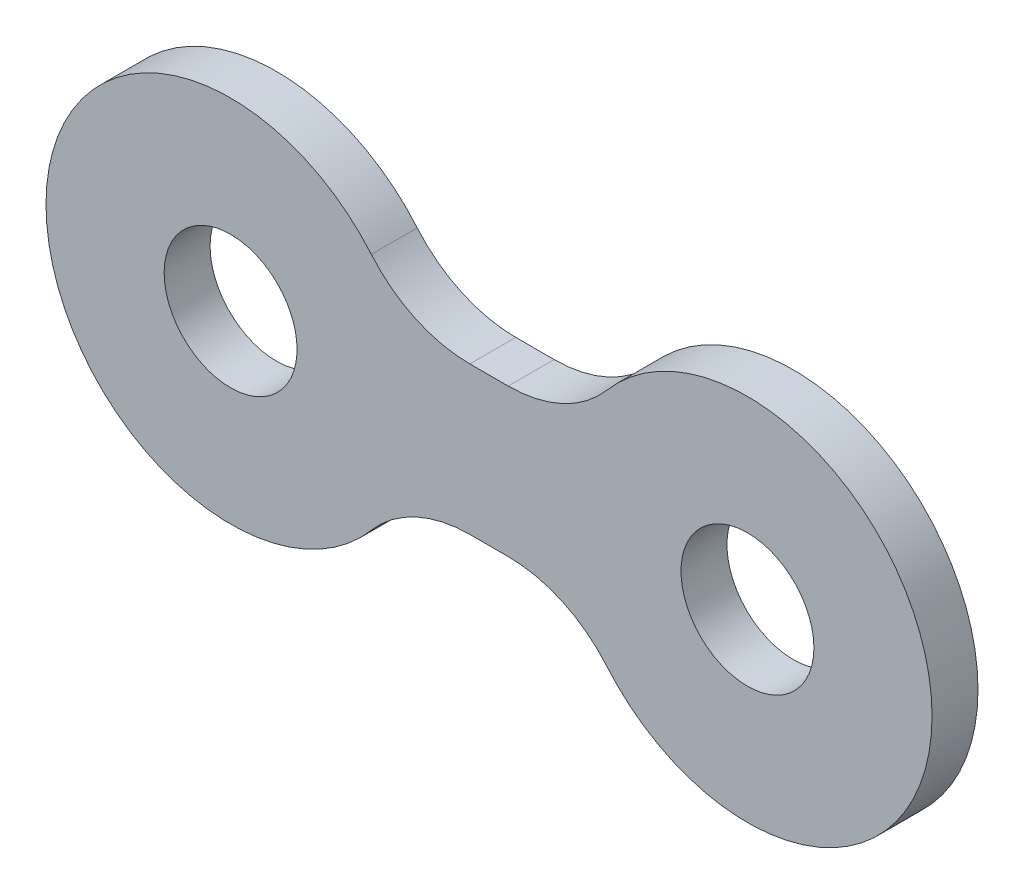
ISO-10303-21;
HEADER;
FILE_DESCRIPTION(('STEP AP214'),'2;1');
FILE_NAME('part.step','',(''),(''),'','','');
FILE_SCHEMA(('AUTOMOTIVE_DESIGN { 1 0 10303 214 1 1 1 1 }'));
ENDSEC;
DATA;
#1=APPLICATION_CONTEXT('core data for automotive mechanical design processes');
#2=APPLICATION_PROTOCOL_DEFINITION('international standard','automotive_design',2000,#1);
#3=PRODUCT_CONTEXT('',#1,'mechanical');
#4=PRODUCT('Part','Part','',(#3));
#5=PRODUCT_RELATED_PRODUCT_CATEGORY('part','',(#4));
#6=PRODUCT_DEFINITION_FORMATION('','',#4);
#7=PRODUCT_DEFINITION_CONTEXT('part definition',#1,'design');
#8=PRODUCT_DEFINITION('design','',#6,#7);
#9=PRODUCT_DEFINITION_SHAPE('','',#8);
#10=(LENGTH_UNIT() NAMED_UNIT(*) SI_UNIT(.MILLI.,.METRE.));
#11=(NAMED_UNIT(*) PLANE_ANGLE_UNIT() SI_UNIT($,.RADIAN.));
#12=(NAMED_UNIT(*) SI_UNIT($,.STERADIAN.) SOLID_ANGLE_UNIT());
#13=UNCERTAINTY_MEASURE_WITH_UNIT(LENGTH_MEASURE(1.E-05),#10,'distance_accuracy_value','');
#14=(GEOMETRIC_REPRESENTATION_CONTEXT(3) GLOBAL_UNCERTAINTY_ASSIGNED_CONTEXT((#13)) GLOBAL_UNIT_ASSIGNED_CONTEXT((#10,
#11,#12)) REPRESENTATION_CONTEXT('',''));
#15=CARTESIAN_POINT('',(0.,0.,0.));
#16=DIRECTION('',(0.,0.,1.));
#17=DIRECTION('',(1.,0.,0.));
#18=AXIS2_PLACEMENT_3D('',#15,#16,#17);
#19=CARTESIAN_POINT('',(-7.,0.,1.2446));
#20=DIRECTION('',(0.,0.,1.));
#21=DIRECTION('',(1.,0.,0.));
#22=AXIS2_PLACEMENT_3D('',#19,#20,#21);
#23=PLANE('',#22);
#24=CARTESIAN_POINT('',(7.,0.,1.2446));
#25=DIRECTION('',(0.,0.,1.));
#26=DIRECTION('',(1.,0.,0.));
#27=AXIS2_PLACEMENT_3D('',#24,#25,#26);
#28=CIRCLE('',#27,1.8);
#29=CARTESIAN_POINT('',(8.8,0.,1.2446));
#30=VERTEX_POINT('',#29);
#31=EDGE_CURVE('E176',#30,#30,#28,.T.);
#32=ORIENTED_EDGE('',*,*,#31,.F.);
#33=EDGE_LOOP('',(#32));
#34=FACE_BOUND('',#33,.T.);
#35=DIRECTION('',(-1.,0.,0.));
#36=VECTOR('',#35,1.);
#37=CARTESIAN_POINT('',(-2.41742430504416,2.,1.2446));
#38=LINE('',#37,#36);
#39=CARTESIAN_POINT('',(0.519259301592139,2.,1.2446));
#40=VERTEX_POINT('',#39);
#41=CARTESIAN_POINT('',(-0.519259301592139,2.,1.2446));
#42=VERTEX_POINT('',#41);
#43=EDGE_CURVE('E135',#40,#42,#38,.T.);
#44=ORIENTED_EDGE('',*,*,#43,.T.);
#45=CARTESIAN_POINT('',(-0.519259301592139,5.5,1.2446));
#46=DIRECTION('',(0.,0.,1.));
#47=DIRECTION('',(1.,0.,0.));
#48=AXIS2_PLACEMENT_3D('',#45,#46,#47);
#49=CIRCLE('',#48,3.5);
#50=CARTESIAN_POINT('',(-3.18779958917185,3.23529411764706,1.2446));
#51=VERTEX_POINT('',#50);
#52=EDGE_CURVE('E11',#42,#51,#49,.F.);
#53=ORIENTED_EDGE('',*,*,#52,.T.);
#54=CARTESIAN_POINT('',(-7.,0.,1.2446));
#55=DIRECTION('',(0.,0.,1.));
#56=DIRECTION('',(1.,0.,0.));
#57=AXIS2_PLACEMENT_3D('',#54,#55,#56);
#58=CIRCLE('',#57,5.);
#59=CARTESIAN_POINT('',(-3.18779958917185,-3.23529411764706,1.2446));
#60=VERTEX_POINT('',#59);
#61=EDGE_CURVE('E129',#51,#60,#58,.T.);
#62=ORIENTED_EDGE('',*,*,#61,.T.);
#63=CARTESIAN_POINT('',(-0.519259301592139,-5.5,1.2446));
#64=DIRECTION('',(0.,0.,1.));
#65=DIRECTION('',(1.,0.,0.));
#66=AXIS2_PLACEMENT_3D('',#63,#64,#65);
#67=CIRCLE('',#66,3.5);
#68=CARTESIAN_POINT('',(-0.519259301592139,-2.,1.2446));
#69=VERTEX_POINT('',#68);
#70=EDGE_CURVE('E151',#60,#69,#67,.F.);
#71=ORIENTED_EDGE('',*,*,#70,.T.);
#72=DIRECTION('',(1.,0.,0.));
#73=VECTOR('',#72,1.);
#74=CARTESIAN_POINT('',(-2.41742430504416,-2.,1.2446));
#75=LINE('',#74,#73);
#76=CARTESIAN_POINT('',(0.519259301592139,-2.,1.2446));
#77=VERTEX_POINT('',#76);
#78=EDGE_CURVE('E167',#69,#77,#75,.T.);
#79=ORIENTED_EDGE('',*,*,#78,.T.);
#80=CARTESIAN_POINT('',(0.519259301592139,-5.5,1.2446));
#81=DIRECTION('',(0.,0.,1.));
#82=DIRECTION('',(1.,0.,0.));
#83=AXIS2_PLACEMENT_3D('',#80,#81,#82);
#84=CIRCLE('',#83,3.5);
#85=CARTESIAN_POINT('',(3.18779958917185,-3.23529411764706,1.2446));
#86=VERTEX_POINT('',#85);
#87=EDGE_CURVE('E108',#77,#86,#84,.F.);
#88=ORIENTED_EDGE('',*,*,#87,.T.);
#89=CARTESIAN_POINT('',(7.,0.,1.2446));
#90=DIRECTION('',(0.,0.,1.));
#91=DIRECTION('',(-1.,0.,0.));
#92=AXIS2_PLACEMENT_3D('',#89,#90,#91);
#93=CIRCLE('',#92,5.);
#94=CARTESIAN_POINT('',(3.18779958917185,3.23529411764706,1.2446));
#95=VERTEX_POINT('',#94);
#96=EDGE_CURVE('E117',#86,#95,#93,.T.);
#97=ORIENTED_EDGE('',*,*,#96,.T.);
#98=CARTESIAN_POINT('',(0.519259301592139,5.5,1.2446));
#99=DIRECTION('',(0.,0.,1.));
#100=DIRECTION('',(1.,0.,0.));
#101=AXIS2_PLACEMENT_3D('',#98,#99,#100);
#102=CIRCLE('',#101,3.5);
#103=EDGE_CURVE('E54',#95,#40,#102,.F.);
#104=ORIENTED_EDGE('',*,*,#103,.T.);
#105=EDGE_LOOP('',(#44,#53,#62,#71,#79,#88,#97,#104));
#106=FACE_BOUND('',#105,.T.);
#107=CARTESIAN_POINT('',(-7.,0.,1.2446));
#108=DIRECTION('',(0.,0.,1.));
#109=DIRECTION('',(-1.,0.,0.));
#110=AXIS2_PLACEMENT_3D('',#107,#108,#109);
#111=CIRCLE('',#110,1.8);
#112=CARTESIAN_POINT('',(-8.8,0.,1.2446));
#113=VERTEX_POINT('',#112);
#114=EDGE_CURVE('E181',#113,#113,#111,.T.);
#115=ORIENTED_EDGE('',*,*,#114,.F.);
#116=EDGE_LOOP('',(#115));
#117=FACE_BOUND('',#116,.T.);
#118=ADVANCED_FACE('F32',(#34,#106,#117),#23,.T.);
#119=CARTESIAN_POINT('',(-7.,0.,0.));
#120=DIRECTION('',(0.,0.,1.));
#121=DIRECTION('',(1.,0.,0.));
#122=AXIS2_PLACEMENT_3D('',#119,#120,#121);
#123=PLANE('',#122);
#124=CARTESIAN_POINT('',(7.,0.,0.));
#125=DIRECTION('',(0.,0.,1.));
#126=DIRECTION('',(1.,0.,0.));
#127=AXIS2_PLACEMENT_3D('',#124,#125,#126);
#128=CIRCLE('',#127,1.8);
#129=CARTESIAN_POINT('',(8.8,0.,0.));
#130=VERTEX_POINT('',#129);
#131=EDGE_CURVE('E172',#130,#130,#128,.T.);
#132=ORIENTED_EDGE('',*,*,#131,.T.);
#133=EDGE_LOOP('',(#132));
#134=FACE_BOUND('',#133,.T.);
#135=CARTESIAN_POINT('',(-7.,0.,0.));
#136=DIRECTION('',(0.,0.,1.));
#137=DIRECTION('',(1.,0.,0.));
#138=AXIS2_PLACEMENT_3D('',#135,#136,#137);
#139=CIRCLE('',#138,5.);
#140=CARTESIAN_POINT('',(-3.18779958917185,3.23529411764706,0.));
#141=VERTEX_POINT('',#140);
#142=CARTESIAN_POINT('',(-3.18779958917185,-3.23529411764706,0.));
#143=VERTEX_POINT('',#142);
#144=EDGE_CURVE('E131',#141,#143,#139,.T.);
#145=ORIENTED_EDGE('',*,*,#144,.F.);
#146=CARTESIAN_POINT('',(-0.519259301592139,5.5,0.));
#147=DIRECTION('',(0.,0.,1.));
#148=DIRECTION('',(1.,0.,0.));
#149=AXIS2_PLACEMENT_3D('',#146,#147,#148);
#150=CIRCLE('',#149,3.5);
#151=CARTESIAN_POINT('',(-0.519259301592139,2.,0.));
#152=VERTEX_POINT('',#151);
#153=EDGE_CURVE('E40',#141,#152,#150,.T.);
#154=ORIENTED_EDGE('',*,*,#153,.T.);
#155=DIRECTION('',(-1.,0.,0.));
#156=VECTOR('',#155,1.);
#157=CARTESIAN_POINT('',(-2.41742430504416,2.,0.));
#158=LINE('',#157,#156);
#159=CARTESIAN_POINT('',(0.519259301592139,2.,0.));
#160=VERTEX_POINT('',#159);
#161=EDGE_CURVE('E126',#160,#152,#158,.T.);
#162=ORIENTED_EDGE('',*,*,#161,.F.);
#163=CARTESIAN_POINT('',(0.519259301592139,5.5,0.));
#164=DIRECTION('',(0.,0.,1.));
#165=DIRECTION('',(1.,0.,0.));
#166=AXIS2_PLACEMENT_3D('',#163,#164,#165);
#167=CIRCLE('',#166,3.5);
#168=CARTESIAN_POINT('',(3.18779958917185,3.23529411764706,0.));
#169=VERTEX_POINT('',#168);
#170=EDGE_CURVE('E125',#160,#169,#167,.T.);
#171=ORIENTED_EDGE('',*,*,#170,.T.);
#172=CARTESIAN_POINT('',(7.,0.,0.));
#173=DIRECTION('',(0.,0.,1.));
#174=DIRECTION('',(-1.,0.,0.));
#175=AXIS2_PLACEMENT_3D('',#172,#173,#174);
#176=CIRCLE('',#175,5.);
#177=CARTESIAN_POINT('',(3.18779958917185,-3.23529411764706,0.));
#178=VERTEX_POINT('',#177);
#179=EDGE_CURVE('E115',#178,#169,#176,.T.);
#180=ORIENTED_EDGE('',*,*,#179,.F.);
#181=CARTESIAN_POINT('',(0.519259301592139,-5.5,0.));
#182=DIRECTION('',(0.,0.,1.));
#183=DIRECTION('',(1.,0.,0.));
#184=AXIS2_PLACEMENT_3D('',#181,#182,#183);
#185=CIRCLE('',#184,3.5);
#186=CARTESIAN_POINT('',(0.519259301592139,-2.,0.));
#187=VERTEX_POINT('',#186);
#188=EDGE_CURVE('E98',#178,#187,#185,.T.);
#189=ORIENTED_EDGE('',*,*,#188,.T.);
#190=DIRECTION('',(1.,0.,0.));
#191=VECTOR('',#190,1.);
#192=CARTESIAN_POINT('',(-2.41742430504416,-2.,0.));
#193=LINE('',#192,#191);
#194=CARTESIAN_POINT('',(-0.519259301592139,-2.,0.));
#195=VERTEX_POINT('',#194);
#196=EDGE_CURVE('E127',#195,#187,#193,.T.);
#197=ORIENTED_EDGE('',*,*,#196,.F.);
#198=CARTESIAN_POINT('',(-0.519259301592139,-5.5,0.));
#199=DIRECTION('',(0.,0.,1.));
#200=DIRECTION('',(1.,0.,0.));
#201=AXIS2_PLACEMENT_3D('',#198,#199,#200);
#202=CIRCLE('',#201,3.5);
#203=EDGE_CURVE('E149',#195,#143,#202,.T.);
#204=ORIENTED_EDGE('',*,*,#203,.T.);
#205=EDGE_LOOP('',(#145,#154,#162,#171,#180,#189,#197,#204));
#206=FACE_BOUND('',#205,.T.);
#207=CARTESIAN_POINT('',(-7.,0.,0.));
#208=DIRECTION('',(0.,0.,1.));
#209=DIRECTION('',(-1.,0.,0.));
#210=AXIS2_PLACEMENT_3D('',#207,#208,#209);
#211=CIRCLE('',#210,1.8);
#212=CARTESIAN_POINT('',(-8.8,0.,0.));
#213=VERTEX_POINT('',#212);
#214=EDGE_CURVE('E183',#213,#213,#211,.T.);
#215=ORIENTED_EDGE('',*,*,#214,.T.);
#216=EDGE_LOOP('',(#215));
#217=FACE_BOUND('',#216,.T.);
#218=ADVANCED_FACE('F122',(#134,#206,#217),#123,.F.);
#219=CARTESIAN_POINT('',(-7.,0.,1.2446));
#220=DIRECTION('',(0.,0.,-1.));
#221=DIRECTION('',(-1.,0.,0.));
#222=AXIS2_PLACEMENT_3D('',#219,#220,#221);
#223=CYLINDRICAL_SURFACE('',#222,5.);
#224=ORIENTED_EDGE('',*,*,#144,.T.);
#225=DIRECTION('',(0.,0.,-1.));
#226=VECTOR('',#225,1.);
#227=CARTESIAN_POINT('',(-3.18779958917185,-3.23529411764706,1.2446));
#228=LINE('',#227,#226);
#229=EDGE_CURVE('E143',#143,#60,#228,.F.);
#230=ORIENTED_EDGE('',*,*,#229,.T.);
#231=ORIENTED_EDGE('',*,*,#61,.F.);
#232=DIRECTION('',(0.,0.,-1.));
#233=VECTOR('',#232,1.);
#234=CARTESIAN_POINT('',(-3.18779958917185,3.23529411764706,1.2446));
#235=LINE('',#234,#233);
#236=EDGE_CURVE('E140',#51,#141,#235,.T.);
#237=ORIENTED_EDGE('',*,*,#236,.T.);
#238=EDGE_LOOP('',(#224,#230,#231,#237));
#239=FACE_BOUND('',#238,.T.);
#240=ADVANCED_FACE('F165',(#239),#223,.T.);
#241=CARTESIAN_POINT('',(-2.41742430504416,-2.,1.2446));
#242=DIRECTION('',(0.,1.,0.));
#243=DIRECTION('',(0.,0.,1.));
#244=AXIS2_PLACEMENT_3D('',#241,#242,#243);
#245=PLANE('',#244);
#246=ORIENTED_EDGE('',*,*,#196,.T.);
#247=DIRECTION('',(0.,0.,1.));
#248=VECTOR('',#247,1.);
#249=CARTESIAN_POINT('',(0.519259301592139,-2.,1.2446));
#250=LINE('',#249,#248);
#251=EDGE_CURVE('E103',#187,#77,#250,.T.);
#252=ORIENTED_EDGE('',*,*,#251,.T.);
#253=ORIENTED_EDGE('',*,*,#78,.F.);
#254=DIRECTION('',(0.,0.,1.));
#255=VECTOR('',#254,1.);
#256=CARTESIAN_POINT('',(-0.519259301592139,-2.,0.));
#257=LINE('',#256,#255);
#258=EDGE_CURVE('E118',#69,#195,#257,.F.);
#259=ORIENTED_EDGE('',*,*,#258,.T.);
#260=EDGE_LOOP('',(#246,#252,#253,#259));
#261=FACE_BOUND('',#260,.T.);
#262=ADVANCED_FACE('F207',(#261),#245,.F.);
#263=CARTESIAN_POINT('',(7.,0.,1.2446));
#264=DIRECTION('',(0.,0.,-1.));
#265=DIRECTION('',(-1.,0.,0.));
#266=AXIS2_PLACEMENT_3D('',#263,#264,#265);
#267=CYLINDRICAL_SURFACE('',#266,5.);
#268=ORIENTED_EDGE('',*,*,#96,.F.);
#269=DIRECTION('',(0.,0.,-1.));
#270=VECTOR('',#269,1.);
#271=CARTESIAN_POINT('',(3.18779958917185,-3.23529411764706,1.2446));
#272=LINE('',#271,#270);
#273=EDGE_CURVE('E102',#86,#178,#272,.T.);
#274=ORIENTED_EDGE('',*,*,#273,.T.);
#275=ORIENTED_EDGE('',*,*,#179,.T.);
#276=DIRECTION('',(0.,0.,-1.));
#277=VECTOR('',#276,1.);
#278=CARTESIAN_POINT('',(3.18779958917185,3.23529411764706,1.2446));
#279=LINE('',#278,#277);
#280=EDGE_CURVE('E119',#169,#95,#279,.F.);
#281=ORIENTED_EDGE('',*,*,#280,.T.);
#282=EDGE_LOOP('',(#268,#274,#275,#281));
#283=FACE_BOUND('',#282,.T.);
#284=ADVANCED_FACE('F114',(#283),#267,.T.);
#285=CARTESIAN_POINT('',(-2.41742430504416,2.,1.2446));
#286=DIRECTION('',(0.,-1.,0.));
#287=DIRECTION('',(0.,0.,-1.));
#288=AXIS2_PLACEMENT_3D('',#285,#286,#287);
#289=PLANE('',#288);
#290=ORIENTED_EDGE('',*,*,#43,.F.);
#291=DIRECTION('',(0.,0.,1.));
#292=VECTOR('',#291,1.);
#293=CARTESIAN_POINT('',(0.519259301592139,2.,0.));
#294=LINE('',#293,#292);
#295=EDGE_CURVE('E109',#40,#160,#294,.F.);
#296=ORIENTED_EDGE('',*,*,#295,.T.);
#297=ORIENTED_EDGE('',*,*,#161,.T.);
#298=DIRECTION('',(0.,0.,1.));
#299=VECTOR('',#298,1.);
#300=CARTESIAN_POINT('',(-0.519259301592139,2.,1.2446));
#301=LINE('',#300,#299);
#302=EDGE_CURVE('E47',#152,#42,#301,.T.);
#303=ORIENTED_EDGE('',*,*,#302,.T.);
#304=EDGE_LOOP('',(#290,#296,#297,#303));
#305=FACE_BOUND('',#304,.T.);
#306=ADVANCED_FACE('F157',(#305),#289,.F.);
#307=CARTESIAN_POINT('',(7.,0.,1.2446));
#308=DIRECTION('',(0.,0.,-1.));
#309=DIRECTION('',(-1.,0.,0.));
#310=AXIS2_PLACEMENT_3D('',#307,#308,#309);
#311=CYLINDRICAL_SURFACE('',#310,1.8);
#312=ORIENTED_EDGE('',*,*,#31,.T.);
#313=EDGE_LOOP('',(#312));
#314=FACE_BOUND('',#313,.T.);
#315=ORIENTED_EDGE('',*,*,#131,.F.);
#316=EDGE_LOOP('',(#315));
#317=FACE_BOUND('',#316,.T.);
#318=ADVANCED_FACE('F200',(#314,#317),#311,.F.);
#319=CARTESIAN_POINT('',(-7.,0.,1.2446));
#320=DIRECTION('',(0.,0.,-1.));
#321=DIRECTION('',(-1.,0.,0.));
#322=AXIS2_PLACEMENT_3D('',#319,#320,#321);
#323=CYLINDRICAL_SURFACE('',#322,1.8);
#324=ORIENTED_EDGE('',*,*,#114,.T.);
#325=EDGE_LOOP('',(#324));
#326=FACE_BOUND('',#325,.T.);
#327=ORIENTED_EDGE('',*,*,#214,.F.);
#328=EDGE_LOOP('',(#327));
#329=FACE_BOUND('',#328,.T.);
#330=ADVANCED_FACE('F189',(#326,#329),#323,.F.);
#331=CARTESIAN_POINT('',(0.519259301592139,-5.5,1.2446));
#332=DIRECTION('',(0.,0.,-1.));
#333=DIRECTION('',(-1.,0.,0.));
#334=AXIS2_PLACEMENT_3D('',#331,#332,#333);
#335=CYLINDRICAL_SURFACE('',#334,3.5);
#336=ORIENTED_EDGE('',*,*,#87,.F.);
#337=ORIENTED_EDGE('',*,*,#251,.F.);
#338=ORIENTED_EDGE('',*,*,#188,.F.);
#339=ORIENTED_EDGE('',*,*,#273,.F.);
#340=EDGE_LOOP('',(#336,#337,#338,#339));
#341=FACE_BOUND('',#340,.T.);
#342=ADVANCED_FACE('F101',(#341),#335,.F.);
#343=CARTESIAN_POINT('',(-0.519259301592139,-5.5,1.2446));
#344=DIRECTION('',(0.,0.,-1.));
#345=DIRECTION('',(-1.,0.,0.));
#346=AXIS2_PLACEMENT_3D('',#343,#344,#345);
#347=CYLINDRICAL_SURFACE('',#346,3.5);
#348=ORIENTED_EDGE('',*,*,#70,.F.);
#349=ORIENTED_EDGE('',*,*,#229,.F.);
#350=ORIENTED_EDGE('',*,*,#203,.F.);
#351=ORIENTED_EDGE('',*,*,#258,.F.);
#352=EDGE_LOOP('',(#348,#349,#350,#351));
#353=FACE_BOUND('',#352,.T.);
#354=ADVANCED_FACE('F215',(#353),#347,.F.);
#355=CARTESIAN_POINT('',(0.519259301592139,5.5,1.2446));
#356=DIRECTION('',(0.,0.,-1.));
#357=DIRECTION('',(-1.,0.,0.));
#358=AXIS2_PLACEMENT_3D('',#355,#356,#357);
#359=CYLINDRICAL_SURFACE('',#358,3.5);
#360=ORIENTED_EDGE('',*,*,#103,.F.);
#361=ORIENTED_EDGE('',*,*,#280,.F.);
#362=ORIENTED_EDGE('',*,*,#170,.F.);
#363=ORIENTED_EDGE('',*,*,#295,.F.);
#364=EDGE_LOOP('',(#360,#361,#362,#363));
#365=FACE_BOUND('',#364,.T.);
#366=ADVANCED_FACE('F217',(#365),#359,.F.);
#367=CARTESIAN_POINT('',(-0.519259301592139,5.5,1.2446));
#368=DIRECTION('',(0.,0.,-1.));
#369=DIRECTION('',(-1.,0.,0.));
#370=AXIS2_PLACEMENT_3D('',#367,#368,#369);
#371=CYLINDRICAL_SURFACE('',#370,3.5);
#372=ORIENTED_EDGE('',*,*,#52,.F.);
#373=ORIENTED_EDGE('',*,*,#302,.F.);
#374=ORIENTED_EDGE('',*,*,#153,.F.);
#375=ORIENTED_EDGE('',*,*,#236,.F.);
#376=EDGE_LOOP('',(#372,#373,#374,#375));
#377=FACE_BOUND('',#376,.T.);
#378=ADVANCED_FACE('F34',(#377),#371,.F.);
#379=CLOSED_SHELL('',(#118,#218,#240,#262,#284,#306,#318,#330,#342,#354,#366,#378));
#380=MANIFOLD_SOLID_BREP('B2',#379);
#381=ADVANCED_BREP_SHAPE_REPRESENTATION('',(#18,#380),#14);
#382=SHAPE_DEFINITION_REPRESENTATION(#9,#381);
ENDSEC;
END-ISO-10303-21;
